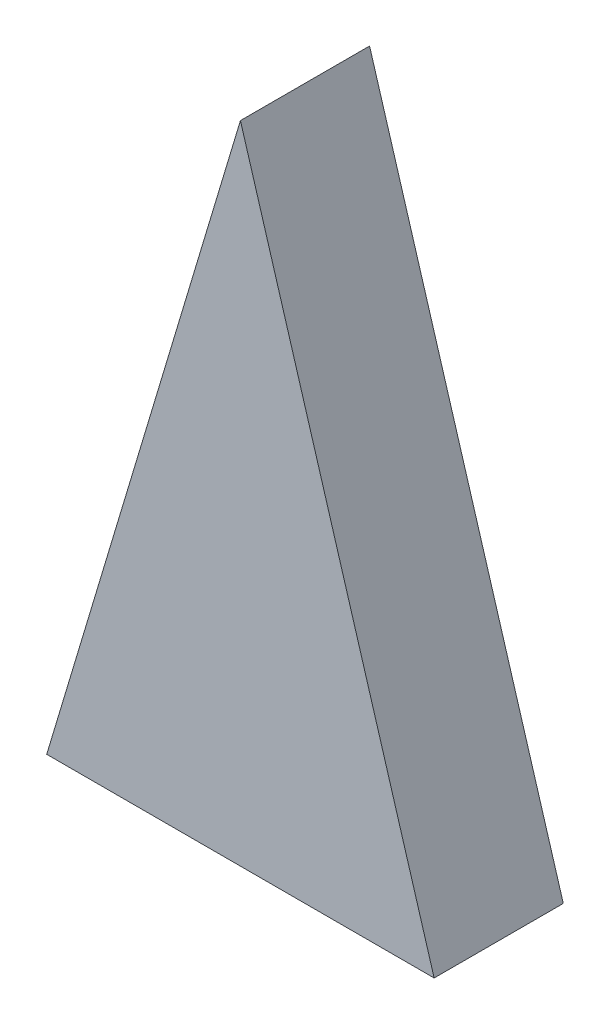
ISO-10303-21;
HEADER;
FILE_DESCRIPTION(('STEP AP214'),'2;1');
FILE_NAME('part.step','',(''),(''),'','','');
FILE_SCHEMA(('AUTOMOTIVE_DESIGN { 1 0 10303 214 1 1 1 1 }'));
ENDSEC;
DATA;
#1=APPLICATION_CONTEXT('core data for automotive mechanical design processes');
#2=APPLICATION_PROTOCOL_DEFINITION('international standard','automotive_design',2000,#1);
#3=PRODUCT_CONTEXT('',#1,'mechanical');
#4=PRODUCT('Part','Part','',(#3));
#5=PRODUCT_RELATED_PRODUCT_CATEGORY('part','',(#4));
#6=PRODUCT_DEFINITION_FORMATION('','',#4);
#7=PRODUCT_DEFINITION_CONTEXT('part definition',#1,'design');
#8=PRODUCT_DEFINITION('design','',#6,#7);
#9=PRODUCT_DEFINITION_SHAPE('','',#8);
#10=(LENGTH_UNIT() NAMED_UNIT(*) SI_UNIT(.MILLI.,.METRE.));
#11=(NAMED_UNIT(*) PLANE_ANGLE_UNIT() SI_UNIT($,.RADIAN.));
#12=(NAMED_UNIT(*) SI_UNIT($,.STERADIAN.) SOLID_ANGLE_UNIT());
#13=UNCERTAINTY_MEASURE_WITH_UNIT(LENGTH_MEASURE(1.E-05),#10,'distance_accuracy_value','');
#14=(GEOMETRIC_REPRESENTATION_CONTEXT(3) GLOBAL_UNCERTAINTY_ASSIGNED_CONTEXT((#13)) GLOBAL_UNIT_ASSIGNED_CONTEXT((#10,
#11,#12)) REPRESENTATION_CONTEXT('',''));
#15=CARTESIAN_POINT('',(0.,0.,0.));
#16=DIRECTION('',(0.,0.,1.));
#17=DIRECTION('',(1.,0.,0.));
#18=AXIS2_PLACEMENT_3D('',#15,#16,#17);
#19=CARTESIAN_POINT('',(15.,0.,5.));
#20=DIRECTION('',(0.,1.,0.));
#21=DIRECTION('',(-1.,0.,0.));
#22=AXIS2_PLACEMENT_3D('',#19,#20,#21);
#23=PLANE('',#22);
#24=DIRECTION('',(1.,0.,0.));
#25=VECTOR('',#24,1.);
#26=CARTESIAN_POINT('',(15.,0.,0.));
#27=LINE('',#26,#25);
#28=CARTESIAN_POINT('',(0.,0.,0.));
#29=VERTEX_POINT('',#28);
#30=CARTESIAN_POINT('',(15.,0.,0.));
#31=VERTEX_POINT('',#30);
#32=EDGE_CURVE('E80',#29,#31,#27,.T.);
#33=ORIENTED_EDGE('',*,*,#32,.T.);
#34=DIRECTION('',(0.,0.,-1.));
#35=VECTOR('',#34,1.);
#36=CARTESIAN_POINT('',(15.,0.,5.));
#37=LINE('',#36,#35);
#38=CARTESIAN_POINT('',(15.,0.,5.));
#39=VERTEX_POINT('',#38);
#40=EDGE_CURVE('E11',#39,#31,#37,.T.);
#41=ORIENTED_EDGE('',*,*,#40,.F.);
#42=DIRECTION('',(1.,0.,0.));
#43=VECTOR('',#42,1.);
#44=CARTESIAN_POINT('',(15.,0.,5.));
#45=LINE('',#44,#43);
#46=CARTESIAN_POINT('',(0.,0.,5.));
#47=VERTEX_POINT('',#46);
#48=EDGE_CURVE('E73',#47,#39,#45,.T.);
#49=ORIENTED_EDGE('',*,*,#48,.F.);
#50=DIRECTION('',(0.,0.,-1.));
#51=VECTOR('',#50,1.);
#52=CARTESIAN_POINT('',(0.,0.,5.));
#53=LINE('',#52,#51);
#54=EDGE_CURVE('E81',#47,#29,#53,.T.);
#55=ORIENTED_EDGE('',*,*,#54,.T.);
#56=EDGE_LOOP('',(#33,#41,#49,#55));
#57=FACE_BOUND('',#56,.T.);
#58=ADVANCED_FACE('F33',(#57),#23,.F.);
#59=CARTESIAN_POINT('',(7.5,25.,5.));
#60=DIRECTION('',(-0.957826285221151,-0.287347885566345,0.));
#61=DIRECTION('',(0.287347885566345,-0.957826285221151,0.));
#62=AXIS2_PLACEMENT_3D('',#59,#60,#61);
#63=PLANE('',#62);
#64=DIRECTION('',(-0.287347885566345,0.957826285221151,0.));
#65=VECTOR('',#64,1.);
#66=CARTESIAN_POINT('',(7.5,25.,0.));
#67=LINE('',#66,#65);
#68=CARTESIAN_POINT('',(7.5,25.,0.));
#69=VERTEX_POINT('',#68);
#70=EDGE_CURVE('E61',#31,#69,#67,.T.);
#71=ORIENTED_EDGE('',*,*,#70,.T.);
#72=DIRECTION('',(0.,0.,-1.));
#73=VECTOR('',#72,1.);
#74=CARTESIAN_POINT('',(7.5,25.,5.));
#75=LINE('',#74,#73);
#76=CARTESIAN_POINT('',(7.5,25.,5.));
#77=VERTEX_POINT('',#76);
#78=EDGE_CURVE('E41',#77,#69,#75,.T.);
#79=ORIENTED_EDGE('',*,*,#78,.F.);
#80=DIRECTION('',(-0.287347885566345,0.957826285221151,0.));
#81=VECTOR('',#80,1.);
#82=CARTESIAN_POINT('',(7.5,25.,5.));
#83=LINE('',#82,#81);
#84=EDGE_CURVE('E69',#39,#77,#83,.T.);
#85=ORIENTED_EDGE('',*,*,#84,.F.);
#86=ORIENTED_EDGE('',*,*,#40,.T.);
#87=EDGE_LOOP('',(#71,#79,#85,#86));
#88=FACE_BOUND('',#87,.T.);
#89=ADVANCED_FACE('F70',(#88),#63,.F.);
#90=CARTESIAN_POINT('',(0.,0.,5.));
#91=DIRECTION('',(0.957826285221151,-0.287347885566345,0.));
#92=DIRECTION('',(0.287347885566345,0.957826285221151,0.));
#93=AXIS2_PLACEMENT_3D('',#90,#91,#92);
#94=PLANE('',#93);
#95=DIRECTION('',(-0.287347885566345,-0.957826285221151,0.));
#96=VECTOR('',#95,1.);
#97=CARTESIAN_POINT('',(0.,0.,0.));
#98=LINE('',#97,#96);
#99=EDGE_CURVE('E66',#69,#29,#98,.T.);
#100=ORIENTED_EDGE('',*,*,#99,.T.);
#101=ORIENTED_EDGE('',*,*,#54,.F.);
#102=DIRECTION('',(-0.287347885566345,-0.957826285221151,0.));
#103=VECTOR('',#102,1.);
#104=CARTESIAN_POINT('',(0.,0.,5.));
#105=LINE('',#104,#103);
#106=EDGE_CURVE('E49',#77,#47,#105,.T.);
#107=ORIENTED_EDGE('',*,*,#106,.F.);
#108=ORIENTED_EDGE('',*,*,#78,.T.);
#109=EDGE_LOOP('',(#100,#101,#107,#108));
#110=FACE_BOUND('',#109,.T.);
#111=ADVANCED_FACE('F88',(#110),#94,.F.);
#112=CARTESIAN_POINT('',(0.,0.,5.));
#113=DIRECTION('',(0.,0.,-1.));
#114=DIRECTION('',(-1.,0.,0.));
#115=AXIS2_PLACEMENT_3D('',#112,#113,#114);
#116=PLANE('',#115);
#117=ORIENTED_EDGE('',*,*,#48,.T.);
#118=ORIENTED_EDGE('',*,*,#84,.T.);
#119=ORIENTED_EDGE('',*,*,#106,.T.);
#120=EDGE_LOOP('',(#117,#118,#119));
#121=FACE_BOUND('',#120,.T.);
#122=ADVANCED_FACE('F76',(#121),#116,.F.);
#123=CARTESIAN_POINT('',(0.,0.,0.));
#124=DIRECTION('',(0.,0.,-1.));
#125=DIRECTION('',(-1.,0.,0.));
#126=AXIS2_PLACEMENT_3D('',#123,#124,#125);
#127=PLANE('',#126);
#128=ORIENTED_EDGE('',*,*,#32,.F.);
#129=ORIENTED_EDGE('',*,*,#99,.F.);
#130=ORIENTED_EDGE('',*,*,#70,.F.);
#131=EDGE_LOOP('',(#128,#129,#130));
#132=FACE_BOUND('',#131,.T.);
#133=ADVANCED_FACE('F89',(#132),#127,.T.);
#134=CLOSED_SHELL('',(#58,#89,#111,#122,#133));
#135=MANIFOLD_SOLID_BREP('B2',#134);
#136=ADVANCED_BREP_SHAPE_REPRESENTATION('',(#18,#135),#14);
#137=SHAPE_DEFINITION_REPRESENTATION(#9,#136);
ENDSEC;
END-ISO-10303-21;
